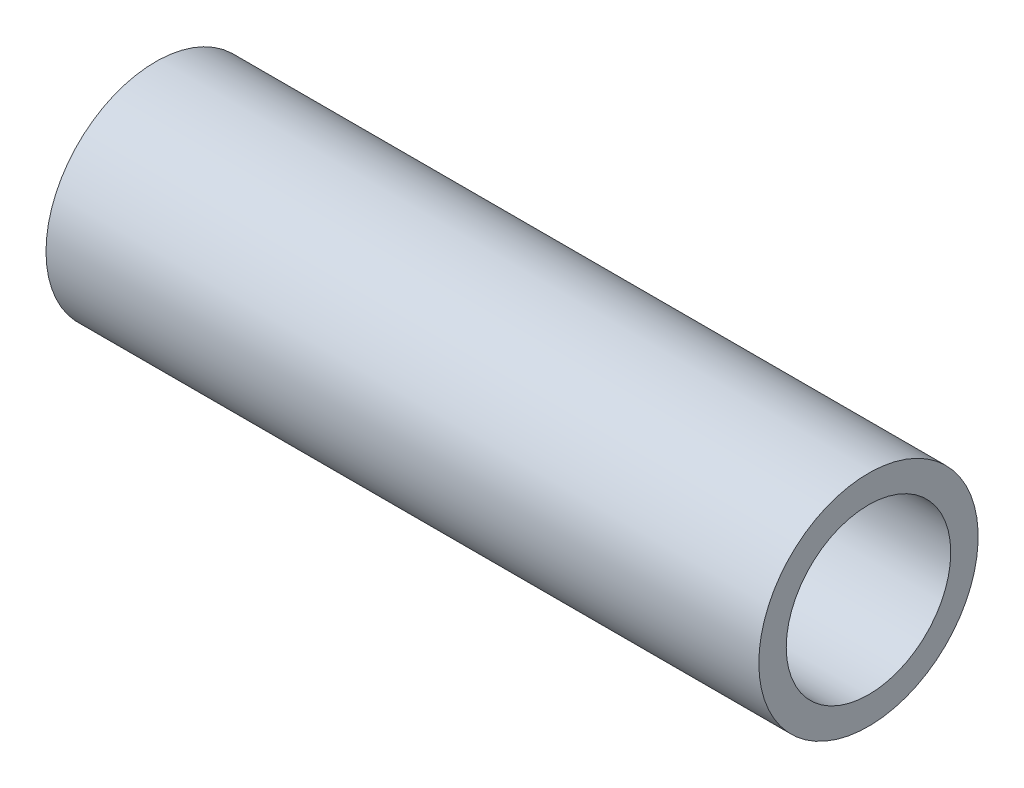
from build123d import *


with BuildPart() as part:
    # Sketch1 → Revolve1 (revolve)
    with BuildSketch(Plane(origin=(0, 0, 0), x_dir=(1, 0, 0), z_dir=(0, 1, 0)), mode=Mode.PRIVATE) as revolve1_sk:
        Polygon((-6.5, 0), (-6, 0), (-5.598076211, 1.5), (6.5, 1.5), (6.5, 2), (-6.5, 2), align=None)
    revolve(revolve1_sk.sketch.rotate(Axis((-6, 0, 0), (1, 0, 0)), 180), axis=Axis((-6, 0, 0), (1, 0, 0)))


solid = part.part
